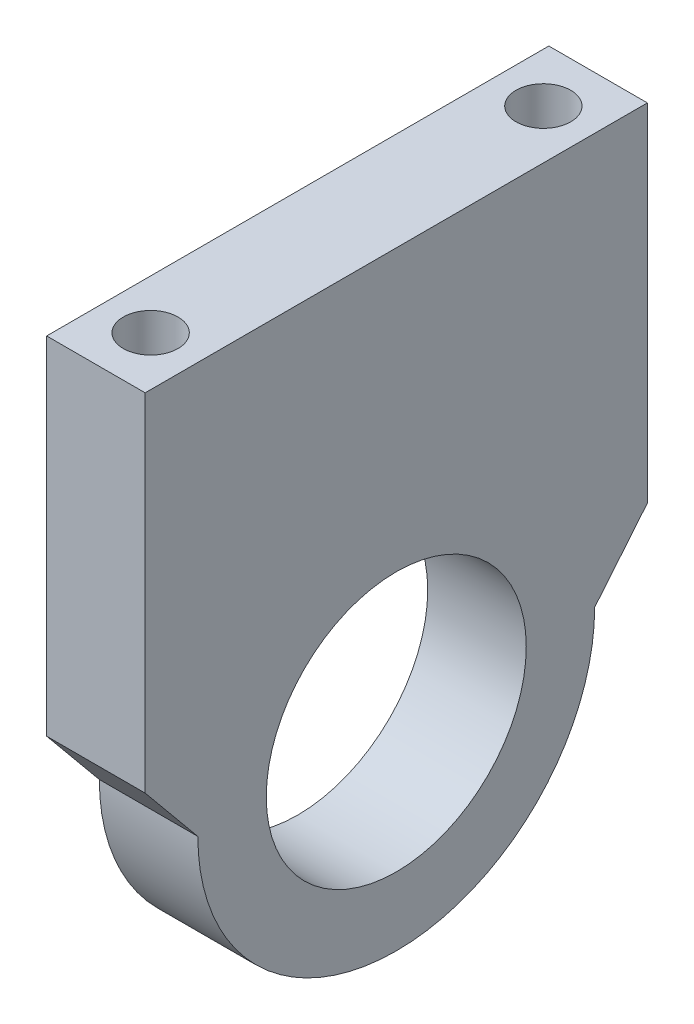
ISO-10303-21;
HEADER;
FILE_DESCRIPTION(('STEP AP214'),'2;1');
FILE_NAME('part.step','',(''),(''),'','','');
FILE_SCHEMA(('AUTOMOTIVE_DESIGN { 1 0 10303 214 1 1 1 1 }'));
ENDSEC;
DATA;
#1=APPLICATION_CONTEXT('core data for automotive mechanical design processes');
#2=APPLICATION_PROTOCOL_DEFINITION('international standard','automotive_design',2000,#1);
#3=PRODUCT_CONTEXT('',#1,'mechanical');
#4=PRODUCT('Part','Part','',(#3));
#5=PRODUCT_RELATED_PRODUCT_CATEGORY('part','',(#4));
#6=PRODUCT_DEFINITION_FORMATION('','',#4);
#7=PRODUCT_DEFINITION_CONTEXT('part definition',#1,'design');
#8=PRODUCT_DEFINITION('design','',#6,#7);
#9=PRODUCT_DEFINITION_SHAPE('','',#8);
#10=(LENGTH_UNIT() NAMED_UNIT(*) SI_UNIT(.MILLI.,.METRE.));
#11=(NAMED_UNIT(*) PLANE_ANGLE_UNIT() SI_UNIT($,.RADIAN.));
#12=(NAMED_UNIT(*) SI_UNIT($,.STERADIAN.) SOLID_ANGLE_UNIT());
#13=UNCERTAINTY_MEASURE_WITH_UNIT(LENGTH_MEASURE(1.E-05),#10,'distance_accuracy_value','');
#14=(GEOMETRIC_REPRESENTATION_CONTEXT(3) GLOBAL_UNCERTAINTY_ASSIGNED_CONTEXT((#13)) GLOBAL_UNIT_ASSIGNED_CONTEXT((#10,
#11,#12)) REPRESENTATION_CONTEXT('',''));
#15=CARTESIAN_POINT('',(0.,0.,0.));
#16=DIRECTION('',(0.,0.,1.));
#17=DIRECTION('',(1.,0.,0.));
#18=AXIS2_PLACEMENT_3D('',#15,#16,#17);
#19=CARTESIAN_POINT('',(-60.,0.,0.));
#20=DIRECTION('',(1.,0.,0.));
#21=DIRECTION('',(0.,0.,-1.));
#22=AXIS2_PLACEMENT_3D('',#19,#20,#21);
#23=CYLINDRICAL_SURFACE('',#22,9.5);
#24=CARTESIAN_POINT('',(-60.,0.,0.));
#25=DIRECTION('',(1.,0.,0.));
#26=DIRECTION('',(0.,0.,-1.));
#27=AXIS2_PLACEMENT_3D('',#24,#25,#26);
#28=CIRCLE('',#27,9.5);
#29=CARTESIAN_POINT('',(-60.,0.,-9.5));
#30=VERTEX_POINT('',#29);
#31=EDGE_CURVE('E247',#30,#30,#28,.T.);
#32=ORIENTED_EDGE('',*,*,#31,.F.);
#33=EDGE_LOOP('',(#32));
#34=FACE_BOUND('',#33,.T.);
#35=CARTESIAN_POINT('',(-52.8,0.,0.));
#36=DIRECTION('',(1.,0.,0.));
#37=DIRECTION('',(0.,0.,-1.));
#38=AXIS2_PLACEMENT_3D('',#35,#36,#37);
#39=CIRCLE('',#38,9.5);
#40=CARTESIAN_POINT('',(-52.8,0.,-9.5));
#41=VERTEX_POINT('',#40);
#42=EDGE_CURVE('E263',#41,#41,#39,.T.);
#43=ORIENTED_EDGE('',*,*,#42,.T.);
#44=EDGE_LOOP('',(#43));
#45=FACE_BOUND('',#44,.T.);
#46=ADVANCED_FACE('F150',(#34,#45),#23,.F.);
#47=CARTESIAN_POINT('',(-60.,0.,0.));
#48=DIRECTION('',(1.,0.,0.));
#49=DIRECTION('',(0.,0.,-1.));
#50=AXIS2_PLACEMENT_3D('',#47,#48,#49);
#51=CYLINDRICAL_SURFACE('',#50,14.5);
#52=CARTESIAN_POINT('',(-52.8,0.,0.));
#53=DIRECTION('',(1.,0.,0.));
#54=DIRECTION('',(0.,0.,-1.));
#55=AXIS2_PLACEMENT_3D('',#52,#53,#54);
#56=CIRCLE('',#55,14.5);
#57=CARTESIAN_POINT('',(-52.8,0.,14.5));
#58=VERTEX_POINT('',#57);
#59=CARTESIAN_POINT('',(-52.8,0.,-14.5));
#60=VERTEX_POINT('',#59);
#61=EDGE_CURVE('E228',#58,#60,#56,.T.);
#62=ORIENTED_EDGE('',*,*,#61,.F.);
#63=DIRECTION('',(1.,0.,0.));
#64=VECTOR('',#63,1.);
#65=CARTESIAN_POINT('',(-60.,0.,14.5));
#66=LINE('',#65,#64);
#67=CARTESIAN_POINT('',(-60.,0.,14.5));
#68=VERTEX_POINT('',#67);
#69=EDGE_CURVE('E230',#68,#58,#66,.T.);
#70=ORIENTED_EDGE('',*,*,#69,.F.);
#71=CARTESIAN_POINT('',(-60.,0.,0.));
#72=DIRECTION('',(1.,0.,0.));
#73=DIRECTION('',(0.,0.,-1.));
#74=AXIS2_PLACEMENT_3D('',#71,#72,#73);
#75=CIRCLE('',#74,14.5);
#76=CARTESIAN_POINT('',(-60.,0.,-14.5));
#77=VERTEX_POINT('',#76);
#78=EDGE_CURVE('E258',#68,#77,#75,.T.);
#79=ORIENTED_EDGE('',*,*,#78,.T.);
#80=DIRECTION('',(1.,0.,0.));
#81=VECTOR('',#80,1.);
#82=CARTESIAN_POINT('',(-60.,0.,-14.5));
#83=LINE('',#82,#81);
#84=EDGE_CURVE('E262',#77,#60,#83,.T.);
#85=ORIENTED_EDGE('',*,*,#84,.T.);
#86=EDGE_LOOP('',(#62,#70,#79,#85));
#87=FACE_BOUND('',#86,.T.);
#88=ADVANCED_FACE('F307',(#87),#51,.T.);
#89=CARTESIAN_POINT('',(-60.,-7.1178876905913,8.62774265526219));
#90=DIRECTION('',(0.,-0.636382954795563,0.771373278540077));
#91=DIRECTION('',(0.,-0.771373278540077,-0.636382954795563));
#92=AXIS2_PLACEMENT_3D('',#89,#90,#91);
#93=PLANE('',#92);
#94=DIRECTION('',(0.,-0.771373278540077,-0.636382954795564));
#95=VECTOR('',#94,1.);
#96=CARTESIAN_POINT('',(-52.8,-7.1178876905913,8.62774265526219));
#97=LINE('',#96,#95);
#98=CARTESIAN_POINT('',(-52.8,4.66666666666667,18.35));
#99=VERTEX_POINT('',#98);
#100=EDGE_CURVE('E240',#99,#58,#97,.T.);
#101=ORIENTED_EDGE('',*,*,#100,.F.);
#102=DIRECTION('',(1.,0.,0.));
#103=VECTOR('',#102,1.);
#104=CARTESIAN_POINT('',(-60.,4.66666666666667,18.35));
#105=LINE('',#104,#103);
#106=CARTESIAN_POINT('',(-60.,4.66666666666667,18.35));
#107=VERTEX_POINT('',#106);
#108=EDGE_CURVE('E272',#107,#99,#105,.T.);
#109=ORIENTED_EDGE('',*,*,#108,.F.);
#110=DIRECTION('',(0.,-0.771373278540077,-0.636382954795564));
#111=VECTOR('',#110,1.);
#112=CARTESIAN_POINT('',(-60.,-7.1178876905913,8.62774265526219));
#113=LINE('',#112,#111);
#114=EDGE_CURVE('E233',#107,#68,#113,.T.);
#115=ORIENTED_EDGE('',*,*,#114,.T.);
#116=ORIENTED_EDGE('',*,*,#69,.T.);
#117=EDGE_LOOP('',(#101,#109,#115,#116));
#118=FACE_BOUND('',#117,.T.);
#119=ADVANCED_FACE('F313',(#118),#93,.T.);
#120=CARTESIAN_POINT('',(-60.,-7.1178876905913,-8.62774265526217));
#121=DIRECTION('',(0.,0.636382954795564,0.771373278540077));
#122=DIRECTION('',(0.,-0.771373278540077,0.636382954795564));
#123=AXIS2_PLACEMENT_3D('',#120,#121,#122);
#124=PLANE('',#123);
#125=DIRECTION('',(0.,-0.771373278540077,0.636382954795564));
#126=VECTOR('',#125,1.);
#127=CARTESIAN_POINT('',(-52.8,-7.1178876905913,-8.62774265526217));
#128=LINE('',#127,#126);
#129=CARTESIAN_POINT('',(-52.8,4.66666666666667,-18.35));
#130=VERTEX_POINT('',#129);
#131=EDGE_CURVE('E219',#130,#60,#128,.T.);
#132=ORIENTED_EDGE('',*,*,#131,.T.);
#133=ORIENTED_EDGE('',*,*,#84,.F.);
#134=DIRECTION('',(0.,-0.771373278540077,0.636382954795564));
#135=VECTOR('',#134,1.);
#136=CARTESIAN_POINT('',(-60.,-7.1178876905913,-8.62774265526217));
#137=LINE('',#136,#135);
#138=CARTESIAN_POINT('',(-60.,4.66666666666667,-18.35));
#139=VERTEX_POINT('',#138);
#140=EDGE_CURVE('E221',#139,#77,#137,.T.);
#141=ORIENTED_EDGE('',*,*,#140,.F.);
#142=DIRECTION('',(1.,0.,0.));
#143=VECTOR('',#142,1.);
#144=CARTESIAN_POINT('',(-60.,4.66666666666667,-18.35));
#145=LINE('',#144,#143);
#146=EDGE_CURVE('E206',#139,#130,#145,.T.);
#147=ORIENTED_EDGE('',*,*,#146,.T.);
#148=EDGE_LOOP('',(#132,#133,#141,#147));
#149=FACE_BOUND('',#148,.T.);
#150=ADVANCED_FACE('F217',(#149),#124,.F.);
#151=CARTESIAN_POINT('',(-60.,0.,-18.35));
#152=DIRECTION('',(0.,0.,1.));
#153=DIRECTION('',(0.,-1.,0.));
#154=AXIS2_PLACEMENT_3D('',#151,#152,#153);
#155=PLANE('',#154);
#156=DIRECTION('',(0.,-1.,0.));
#157=VECTOR('',#156,1.);
#158=CARTESIAN_POINT('',(-60.,0.,-18.35));
#159=LINE('',#158,#157);
#160=CARTESIAN_POINT('',(-60.,30.,-18.35));
#161=VERTEX_POINT('',#160);
#162=EDGE_CURVE('E252',#161,#139,#159,.T.);
#163=ORIENTED_EDGE('',*,*,#162,.F.);
#164=DIRECTION('',(1.,0.,0.));
#165=VECTOR('',#164,1.);
#166=CARTESIAN_POINT('',(-60.,30.,-18.35));
#167=LINE('',#166,#165);
#168=CARTESIAN_POINT('',(-52.8,30.,-18.35));
#169=VERTEX_POINT('',#168);
#170=EDGE_CURVE('E209',#161,#169,#167,.T.);
#171=ORIENTED_EDGE('',*,*,#170,.T.);
#172=DIRECTION('',(0.,-1.,0.));
#173=VECTOR('',#172,1.);
#174=CARTESIAN_POINT('',(-52.8,0.,-18.35));
#175=LINE('',#174,#173);
#176=EDGE_CURVE('E202',#169,#130,#175,.T.);
#177=ORIENTED_EDGE('',*,*,#176,.T.);
#178=ORIENTED_EDGE('',*,*,#146,.F.);
#179=EDGE_LOOP('',(#163,#171,#177,#178));
#180=FACE_BOUND('',#179,.T.);
#181=ADVANCED_FACE('F205',(#180),#155,.F.);
#182=CARTESIAN_POINT('',(-60.,0.,18.35));
#183=DIRECTION('',(0.,0.,-1.));
#184=DIRECTION('',(-1.,0.,0.));
#185=AXIS2_PLACEMENT_3D('',#182,#183,#184);
#186=PLANE('',#185);
#187=DIRECTION('',(0.,1.,0.));
#188=VECTOR('',#187,1.);
#189=CARTESIAN_POINT('',(-52.8,0.,18.35));
#190=LINE('',#189,#188);
#191=CARTESIAN_POINT('',(-52.8,30.,18.35));
#192=VERTEX_POINT('',#191);
#193=EDGE_CURVE('E213',#99,#192,#190,.T.);
#194=ORIENTED_EDGE('',*,*,#193,.T.);
#195=DIRECTION('',(-1.,0.,0.));
#196=VECTOR('',#195,1.);
#197=CARTESIAN_POINT('',(-60.,30.,18.35));
#198=LINE('',#197,#196);
#199=CARTESIAN_POINT('',(-60.,30.,18.35));
#200=VERTEX_POINT('',#199);
#201=EDGE_CURVE('E169',#192,#200,#198,.T.);
#202=ORIENTED_EDGE('',*,*,#201,.T.);
#203=DIRECTION('',(0.,1.,0.));
#204=VECTOR('',#203,1.);
#205=CARTESIAN_POINT('',(-60.,0.,18.35));
#206=LINE('',#205,#204);
#207=EDGE_CURVE('E239',#107,#200,#206,.T.);
#208=ORIENTED_EDGE('',*,*,#207,.F.);
#209=ORIENTED_EDGE('',*,*,#108,.T.);
#210=EDGE_LOOP('',(#194,#202,#208,#209));
#211=FACE_BOUND('',#210,.T.);
#212=ADVANCED_FACE('F324',(#211),#186,.F.);
#213=CARTESIAN_POINT('',(-52.8,0.,0.));
#214=DIRECTION('',(1.,0.,0.));
#215=DIRECTION('',(0.,0.,-1.));
#216=AXIS2_PLACEMENT_3D('',#213,#214,#215);
#217=PLANE('',#216);
#218=DIRECTION('',(0.,0.,1.));
#219=VECTOR('',#218,1.);
#220=CARTESIAN_POINT('',(-52.8,30.,18.35));
#221=LINE('',#220,#219);
#222=EDGE_CURVE('E243',#169,#192,#221,.T.);
#223=ORIENTED_EDGE('',*,*,#222,.T.);
#224=ORIENTED_EDGE('',*,*,#193,.F.);
#225=ORIENTED_EDGE('',*,*,#100,.T.);
#226=ORIENTED_EDGE('',*,*,#61,.T.);
#227=ORIENTED_EDGE('',*,*,#131,.F.);
#228=ORIENTED_EDGE('',*,*,#176,.F.);
#229=EDGE_LOOP('',(#223,#224,#225,#226,#227,#228));
#230=FACE_BOUND('',#229,.T.);
#231=ORIENTED_EDGE('',*,*,#42,.F.);
#232=EDGE_LOOP('',(#231));
#233=FACE_BOUND('',#232,.T.);
#234=ADVANCED_FACE('F224',(#230,#233),#217,.T.);
#235=CARTESIAN_POINT('',(-60.,0.,0.));
#236=DIRECTION('',(1.,0.,0.));
#237=DIRECTION('',(0.,0.,-1.));
#238=AXIS2_PLACEMENT_3D('',#235,#236,#237);
#239=PLANE('',#238);
#240=ORIENTED_EDGE('',*,*,#207,.T.);
#241=DIRECTION('',(0.,0.,-1.));
#242=VECTOR('',#241,1.);
#243=CARTESIAN_POINT('',(-60.,30.,18.35));
#244=LINE('',#243,#242);
#245=EDGE_CURVE('E255',#200,#161,#244,.T.);
#246=ORIENTED_EDGE('',*,*,#245,.T.);
#247=ORIENTED_EDGE('',*,*,#162,.T.);
#248=ORIENTED_EDGE('',*,*,#140,.T.);
#249=ORIENTED_EDGE('',*,*,#78,.F.);
#250=ORIENTED_EDGE('',*,*,#114,.F.);
#251=EDGE_LOOP('',(#240,#246,#247,#248,#249,#250));
#252=FACE_BOUND('',#251,.T.);
#253=ORIENTED_EDGE('',*,*,#31,.T.);
#254=EDGE_LOOP('',(#253));
#255=FACE_BOUND('',#254,.T.);
#256=ADVANCED_FACE('F323',(#252,#255),#239,.F.);
#257=CARTESIAN_POINT('',(4.77750000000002,30.,0.));
#258=DIRECTION('',(0.,-1.,0.));
#259=DIRECTION('',(0.,0.,-1.));
#260=AXIS2_PLACEMENT_3D('',#257,#258,#259);
#261=PLANE('',#260);
#262=CARTESIAN_POINT('',(-56.4,30.,14.35));
#263=DIRECTION('',(0.,-1.,0.));
#264=DIRECTION('',(0.,0.,-1.));
#265=AXIS2_PLACEMENT_3D('',#262,#263,#264);
#266=CIRCLE('',#265,2.);
#267=CARTESIAN_POINT('',(-56.4,30.,12.35));
#268=VERTEX_POINT('',#267);
#269=EDGE_CURVE('E251',#268,#268,#266,.T.);
#270=ORIENTED_EDGE('',*,*,#269,.T.);
#271=EDGE_LOOP('',(#270));
#272=FACE_BOUND('',#271,.T.);
#273=ORIENTED_EDGE('',*,*,#222,.F.);
#274=ORIENTED_EDGE('',*,*,#170,.F.);
#275=ORIENTED_EDGE('',*,*,#245,.F.);
#276=ORIENTED_EDGE('',*,*,#201,.F.);
#277=EDGE_LOOP('',(#273,#274,#275,#276));
#278=FACE_BOUND('',#277,.T.);
#279=CARTESIAN_POINT('',(-56.4,30.,-14.35));
#280=DIRECTION('',(0.,-1.,0.));
#281=DIRECTION('',(0.,0.,-1.));
#282=AXIS2_PLACEMENT_3D('',#279,#280,#281);
#283=CIRCLE('',#282,2.);
#284=CARTESIAN_POINT('',(-56.4,30.,-16.35));
#285=VERTEX_POINT('',#284);
#286=EDGE_CURVE('E154',#285,#285,#283,.T.);
#287=ORIENTED_EDGE('',*,*,#286,.T.);
#288=EDGE_LOOP('',(#287));
#289=FACE_BOUND('',#288,.T.);
#290=ADVANCED_FACE('F152',(#272,#278,#289),#261,.F.);
#291=CARTESIAN_POINT('',(-56.4,23.3,-14.35));
#292=DIRECTION('',(0.,-1.,0.));
#293=DIRECTION('',(0.,0.,-1.));
#294=AXIS2_PLACEMENT_3D('',#291,#292,#293);
#295=PLANE('',#294);
#296=CARTESIAN_POINT('',(-56.4,23.3,-14.35));
#297=DIRECTION('',(0.,-1.,0.));
#298=DIRECTION('',(0.,0.,-1.));
#299=AXIS2_PLACEMENT_3D('',#296,#297,#298);
#300=CIRCLE('',#299,2.);
#301=CARTESIAN_POINT('',(-56.4,23.3,-16.35));
#302=VERTEX_POINT('',#301);
#303=EDGE_CURVE('E161',#302,#302,#300,.T.);
#304=ORIENTED_EDGE('',*,*,#303,.F.);
#305=EDGE_LOOP('',(#304));
#306=FACE_BOUND('',#305,.T.);
#307=ADVANCED_FACE('F294',(#306),#295,.F.);
#308=CARTESIAN_POINT('',(-56.4,23.3,-14.35));
#309=DIRECTION('',(0.,1.,0.));
#310=DIRECTION('',(0.,0.,1.));
#311=AXIS2_PLACEMENT_3D('',#308,#309,#310);
#312=CYLINDRICAL_SURFACE('',#311,2.);
#313=ORIENTED_EDGE('',*,*,#303,.T.);
#314=EDGE_LOOP('',(#313));
#315=FACE_BOUND('',#314,.T.);
#316=ORIENTED_EDGE('',*,*,#286,.F.);
#317=EDGE_LOOP('',(#316));
#318=FACE_BOUND('',#317,.T.);
#319=ADVANCED_FACE('F291',(#315,#318),#312,.F.);
#320=CARTESIAN_POINT('',(-56.4,23.3,14.35));
#321=DIRECTION('',(0.,1.,0.));
#322=DIRECTION('',(0.,0.,1.));
#323=AXIS2_PLACEMENT_3D('',#320,#321,#322);
#324=CYLINDRICAL_SURFACE('',#323,2.);
#325=CARTESIAN_POINT('',(-56.4,23.3,14.35));
#326=DIRECTION('',(0.,-1.,0.));
#327=DIRECTION('',(0.,0.,-1.));
#328=AXIS2_PLACEMENT_3D('',#325,#326,#327);
#329=CIRCLE('',#328,2.);
#330=CARTESIAN_POINT('',(-56.4,23.3,12.35));
#331=VERTEX_POINT('',#330);
#332=EDGE_CURVE('E13',#331,#331,#329,.T.);
#333=ORIENTED_EDGE('',*,*,#332,.T.);
#334=EDGE_LOOP('',(#333));
#335=FACE_BOUND('',#334,.T.);
#336=ORIENTED_EDGE('',*,*,#269,.F.);
#337=EDGE_LOOP('',(#336));
#338=FACE_BOUND('',#337,.T.);
#339=ADVANCED_FACE('F293',(#335,#338),#324,.F.);
#340=CARTESIAN_POINT('',(-56.4,23.3,14.35));
#341=DIRECTION('',(0.,-1.,0.));
#342=DIRECTION('',(0.,0.,-1.));
#343=AXIS2_PLACEMENT_3D('',#340,#341,#342);
#344=PLANE('',#343);
#345=ORIENTED_EDGE('',*,*,#332,.F.);
#346=EDGE_LOOP('',(#345));
#347=FACE_BOUND('',#346,.T.);
#348=ADVANCED_FACE('F301',(#347),#344,.F.);
#349=CLOSED_SHELL('',(#46,#88,#119,#150,#181,#212,#234,#256,#290,#307,#319,#339,#348));
#350=MANIFOLD_SOLID_BREP('B2',#349);
#351=ADVANCED_BREP_SHAPE_REPRESENTATION('',(#18,#350),#14);
#352=SHAPE_DEFINITION_REPRESENTATION(#9,#351);
ENDSEC;
END-ISO-10303-21;
